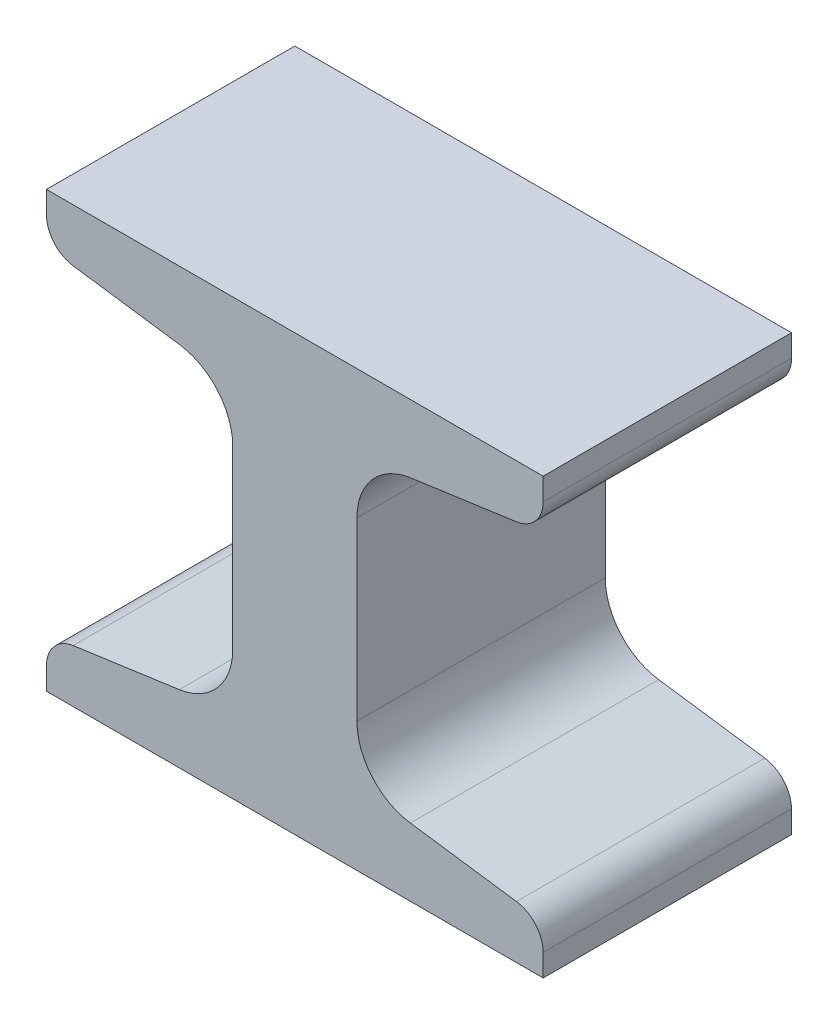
from build123d import *

# Parameters (mm, degrees)
BASESBEAM_DEPTH = 12.7
TOEFILLET_R     = 3.175


with BuildPart() as part:
    # Sketch1 → BaseSbeam (new, symmetric)
    with BuildSketch(Plane.XY):
        with BuildLine():
            Line((0, 0), (0, 5.025701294))
            Line((0, 5.025701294), (13.583749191, 6.934772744))
            ThreePointArc((13.583749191, 6.934772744), (17.492405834, 9.057000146), (19.05, 13.22297498))
            Line((19.05, 13.22297498), (19.05, 31.22702502))
            ThreePointArc((19.05, 31.22702502), (17.492405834, 35.392999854), (13.583749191, 37.515227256))
            Line((13.583749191, 37.515227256), (0, 39.424298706))
            Line((0, 39.424298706), (0, 44.45))
            Line((0, 44.45), (50.8, 44.45))
            Line((50.8, 44.45), (50.8, 39.424298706))
            Line((50.8, 39.424298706), (37.216250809, 37.515227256))
            ThreePointArc((37.216250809, 37.515227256), (33.307594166, 35.392999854), (31.75, 31.22702502))
            Line((31.75, 31.22702502), (31.75, 13.22297498))
            ThreePointArc((31.75, 13.22297498), (33.307594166, 9.057000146), (37.216250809, 6.934772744))
            Line((37.216250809, 6.934772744), (50.8, 5.025701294))
            Line((50.8, 5.025701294), (50.8, 0))
            Line((50.8, 0), (0, 0))
        make_face()
    extrude(amount=BASESBEAM_DEPTH, both=True)

    # ToeFillet
    toefillet_edges = [part.edges().sort_by_distance(p)[0] for p in [
        (50.8, 5.025701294, 0),
        (50.8, 39.424298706, 0),
        (0, 39.424298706, 0),
        (0, 5.025701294, 0),
    ]]
    fillet(toefillet_edges, radius=TOEFILLET_R)


solid = part.part
